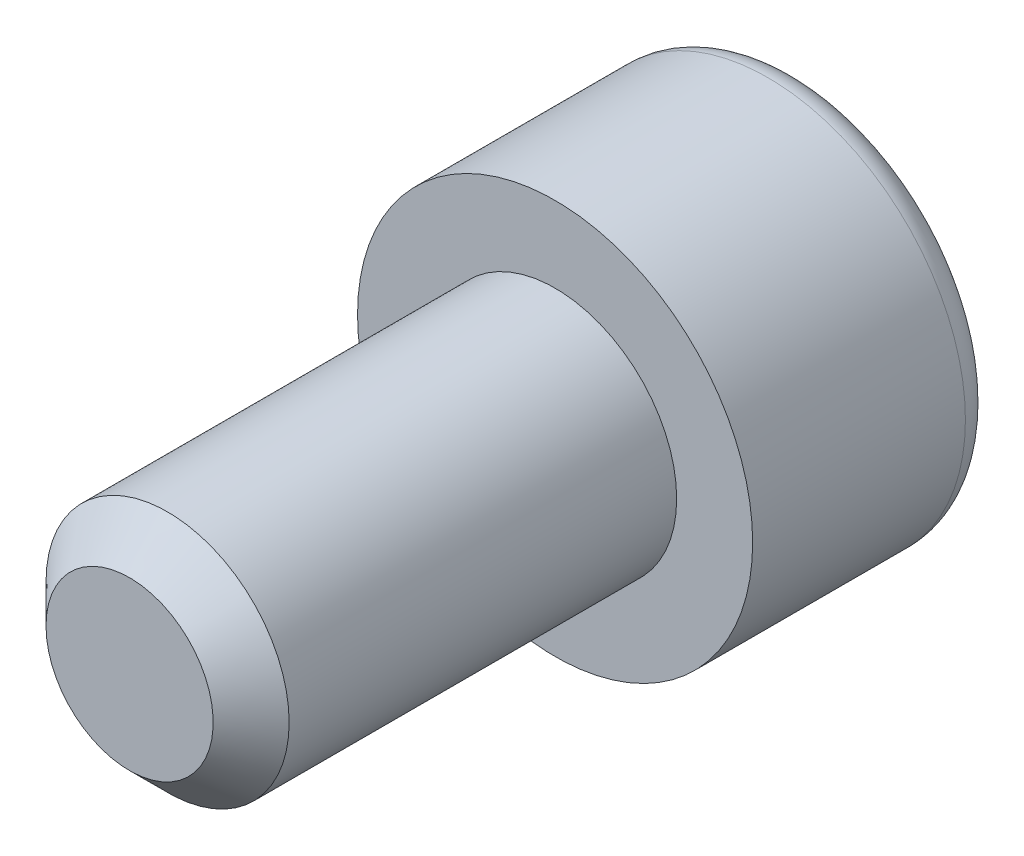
ISO-10303-21;
HEADER;
FILE_DESCRIPTION(('STEP AP214'),'2;1');
FILE_NAME('part.step','',(''),(''),'','','');
FILE_SCHEMA(('AUTOMOTIVE_DESIGN { 1 0 10303 214 1 1 1 1 }'));
ENDSEC;
DATA;
#1=APPLICATION_CONTEXT('core data for automotive mechanical design processes');
#2=APPLICATION_PROTOCOL_DEFINITION('international standard','automotive_design',2000,#1);
#3=PRODUCT_CONTEXT('',#1,'mechanical');
#4=PRODUCT('Part','Part','',(#3));
#5=PRODUCT_RELATED_PRODUCT_CATEGORY('part','',(#4));
#6=PRODUCT_DEFINITION_FORMATION('','',#4);
#7=PRODUCT_DEFINITION_CONTEXT('part definition',#1,'design');
#8=PRODUCT_DEFINITION('design','',#6,#7);
#9=PRODUCT_DEFINITION_SHAPE('','',#8);
#10=(LENGTH_UNIT() NAMED_UNIT(*) SI_UNIT(.MILLI.,.METRE.));
#11=(NAMED_UNIT(*) PLANE_ANGLE_UNIT() SI_UNIT($,.RADIAN.));
#12=(NAMED_UNIT(*) SI_UNIT($,.STERADIAN.) SOLID_ANGLE_UNIT());
#13=UNCERTAINTY_MEASURE_WITH_UNIT(LENGTH_MEASURE(1.E-05),#10,'distance_accuracy_value','');
#14=(GEOMETRIC_REPRESENTATION_CONTEXT(3) GLOBAL_UNCERTAINTY_ASSIGNED_CONTEXT((#13)) GLOBAL_UNIT_ASSIGNED_CONTEXT((#10,
#11,#12)) REPRESENTATION_CONTEXT('',''));
#15=CARTESIAN_POINT('',(0.,0.,0.));
#16=DIRECTION('',(0.,0.,1.));
#17=DIRECTION('',(1.,0.,0.));
#18=AXIS2_PLACEMENT_3D('',#15,#16,#17);
#19=CARTESIAN_POINT('',(0.,0.,14.));
#20=DIRECTION('',(0.,0.,-0.999999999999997));
#21=DIRECTION('',(-1.,0.,0.));
#22=AXIS2_PLACEMENT_3D('',#19,#20,#21);
#23=CYLINDRICAL_SURFACE('',#22,4.);
#24=CARTESIAN_POINT('',(0.,0.,12.75));
#25=DIRECTION('',(0.,0.,0.999999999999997));
#26=DIRECTION('',(1.,0.,0.));
#27=AXIS2_PLACEMENT_3D('',#24,#25,#26);
#28=CIRCLE('',#27,4.);
#29=CARTESIAN_POINT('',(-4.,0.,12.75));
#30=VERTEX_POINT('',#29);
#31=EDGE_CURVE('E145',#30,#30,#28,.F.);
#32=CARTESIAN_POINT('',(0.,0.,0.));
#33=DIRECTION('',(0.,0.,-0.999999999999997));
#34=DIRECTION('',(-1.,0.,0.));
#35=AXIS2_PLACEMENT_3D('',#32,#33,#34);
#36=CIRCLE('',#35,4.);
#37=CARTESIAN_POINT('',(-4.,0.,0.));
#38=VERTEX_POINT('',#37);
#39=EDGE_CURVE('E139',#38,#38,#36,.T.);
#40=CARTESIAN_POINT('',(-4.,0.,12.75));
#41=CARTESIAN_POINT('',(-4.,0.,12.6171875));
#42=CARTESIAN_POINT('',(-4.,0.,12.484375));
#43=CARTESIAN_POINT('',(-4.,0.,12.21875));
#44=CARTESIAN_POINT('',(-4.,0.,12.0859375));
#45=CARTESIAN_POINT('',(-4.,0.,11.8203125));
#46=CARTESIAN_POINT('',(-4.,0.,11.6875));
#47=CARTESIAN_POINT('',(-4.,0.,11.421875));
#48=CARTESIAN_POINT('',(-4.,0.,11.2890625));
#49=CARTESIAN_POINT('',(-4.,0.,11.0234375));
#50=CARTESIAN_POINT('',(-4.,0.,10.890625));
#51=CARTESIAN_POINT('',(-4.,0.,10.625));
#52=CARTESIAN_POINT('',(-4.,0.,10.4921875));
#53=CARTESIAN_POINT('',(-4.,0.,10.2265625));
#54=CARTESIAN_POINT('',(-4.,0.,10.09375));
#55=CARTESIAN_POINT('',(-4.,0.,9.82812500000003));
#56=CARTESIAN_POINT('',(-4.,0.,9.69531250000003));
#57=CARTESIAN_POINT('',(-4.,0.,9.42968750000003));
#58=CARTESIAN_POINT('',(-4.,0.,9.29687500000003));
#59=CARTESIAN_POINT('',(-4.,0.,9.03125000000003));
#60=CARTESIAN_POINT('',(-4.,0.,8.89843750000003));
#61=CARTESIAN_POINT('',(-4.,0.,8.63281250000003));
#62=CARTESIAN_POINT('',(-4.,0.,8.50000000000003));
#63=CARTESIAN_POINT('',(-4.,0.,8.23437500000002));
#64=CARTESIAN_POINT('',(-4.,0.,8.10156250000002));
#65=CARTESIAN_POINT('',(-4.,0.,7.83593750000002));
#66=CARTESIAN_POINT('',(-4.,0.,7.70312500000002));
#67=CARTESIAN_POINT('',(-4.,0.,7.43750000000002));
#68=CARTESIAN_POINT('',(-4.,0.,7.30468750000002));
#69=CARTESIAN_POINT('',(-4.,0.,7.03906250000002));
#70=CARTESIAN_POINT('',(-4.,0.,6.90625000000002));
#71=CARTESIAN_POINT('',(-4.,0.,6.64062500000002));
#72=CARTESIAN_POINT('',(-4.,0.,6.50781250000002));
#73=CARTESIAN_POINT('',(-4.,0.,6.24218750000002));
#74=CARTESIAN_POINT('',(-4.,0.,6.10937500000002));
#75=CARTESIAN_POINT('',(-4.,0.,5.84375000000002));
#76=CARTESIAN_POINT('',(-4.,0.,5.71093750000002));
#77=CARTESIAN_POINT('',(-4.,0.,5.44531250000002));
#78=CARTESIAN_POINT('',(-4.,0.,5.31250000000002));
#79=CARTESIAN_POINT('',(-4.,0.,5.04687500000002));
#80=CARTESIAN_POINT('',(-4.,0.,4.91406250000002));
#81=CARTESIAN_POINT('',(-4.,0.,4.64843750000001));
#82=CARTESIAN_POINT('',(-4.,0.,4.51562500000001));
#83=CARTESIAN_POINT('',(-4.,0.,4.25000000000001));
#84=CARTESIAN_POINT('',(-4.,0.,4.11718750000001));
#85=CARTESIAN_POINT('',(-4.,0.,3.85156250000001));
#86=CARTESIAN_POINT('',(-4.,0.,3.71875000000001));
#87=CARTESIAN_POINT('',(-4.,0.,3.45312500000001));
#88=CARTESIAN_POINT('',(-4.,0.,3.32031250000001));
#89=CARTESIAN_POINT('',(-4.,0.,3.05468750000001));
#90=CARTESIAN_POINT('',(-4.,0.,2.92187500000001));
#91=CARTESIAN_POINT('',(-4.,0.,2.65625000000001));
#92=CARTESIAN_POINT('',(-4.,0.,2.52343750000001));
#93=CARTESIAN_POINT('',(-4.,0.,2.25781250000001));
#94=CARTESIAN_POINT('',(-4.,0.,2.12500000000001));
#95=CARTESIAN_POINT('',(-4.,0.,1.85937500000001));
#96=CARTESIAN_POINT('',(-4.,0.,1.72656250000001));
#97=CARTESIAN_POINT('',(-4.,0.,1.4609375));
#98=CARTESIAN_POINT('',(-4.,0.,1.328125));
#99=CARTESIAN_POINT('',(-4.,0.,1.0625));
#100=CARTESIAN_POINT('',(-4.,0.,0.929687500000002));
#101=CARTESIAN_POINT('',(-4.,0.,0.664062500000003));
#102=CARTESIAN_POINT('',(-4.,0.,0.531250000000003));
#103=CARTESIAN_POINT('',(-4.,0.,0.265625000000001));
#104=CARTESIAN_POINT('',(-4.,0.,0.1328125));
#105=CARTESIAN_POINT('',(-4.,0.,0.));
#106=B_SPLINE_CURVE_WITH_KNOTS('',3,(#40,#41,#42,#43,#44,#45,#46,#47,#48,#49,#50,#51,#52,#53,
#54,#55,#56,#57,#58,#59,#60,#61,#62,#63,#64,#65,#66,#67,#68,#69,#70,#71,#72,#73,#74,#75,#76,#77,
#78,#79,#80,#81,#82,#83,#84,#85,#86,#87,#88,#89,#90,#91,#92,#93,#94,#95,#96,#97,#98,#99,#100,
#101,#102,#103,#104,#105),.UNSPECIFIED.,.F.,.F.,(4,2,2,2,2,2,2,2,2,2,2,2,2,2,2,2,2,2,2,2,2,2,2,
2,2,2,2,2,2,2,2,2,4),(0.,0.398437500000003,0.796875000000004,1.19531250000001,1.59375000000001,
1.99218750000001,2.39062500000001,2.78906250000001,3.18750000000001,3.58593750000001,
3.98437500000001,4.38281250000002,4.78125000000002,5.17968750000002,5.57812500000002,
5.97656250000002,6.37500000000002,6.77343750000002,7.17187500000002,7.57031250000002,
7.96875000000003,8.36718750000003,8.76562500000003,9.16406250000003,9.56250000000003,
9.96093750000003,10.359375,10.7578125,11.15625,11.5546875,11.953125,12.3515625,12.75),.UNSPECIFIED.);
#107=EDGE_CURVE('BSEAM28',#30,#38,#106,.T.);
#108=ORIENTED_EDGE('',*,*,#31,.T.);
#109=ORIENTED_EDGE('',*,*,#39,.F.);
#110=ORIENTED_EDGE('',*,*,#107,.T.);
#111=ORIENTED_EDGE('',*,*,#107,.F.);
#112=EDGE_LOOP('',(#108,#110,#109,#111));
#113=FACE_BOUND('',#112,.T.);
#114=ADVANCED_FACE('F28',(#113),#23,.T.);
#115=CARTESIAN_POINT('',(0.,0.,14.));
#116=DIRECTION('',(0.,0.,0.999999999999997));
#117=DIRECTION('',(1.,0.,0.));
#118=AXIS2_PLACEMENT_3D('',#115,#116,#117);
#119=PLANE('',#118);
#120=CARTESIAN_POINT('',(0.,0.,14.));
#121=DIRECTION('',(0.,0.,0.999999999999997));
#122=DIRECTION('',(1.,0.,0.));
#123=AXIS2_PLACEMENT_3D('',#120,#121,#122);
#124=CIRCLE('',#123,2.75);
#125=CARTESIAN_POINT('',(-2.75,0.,14.));
#126=VERTEX_POINT('',#125);
#127=EDGE_CURVE('E142',#126,#126,#124,.T.);
#128=ORIENTED_EDGE('',*,*,#127,.T.);
#129=EDGE_LOOP('',(#128));
#130=FACE_BOUND('',#129,.T.);
#131=ADVANCED_FACE('F166',(#130),#119,.T.);
#132=CARTESIAN_POINT('',(0.,0.,0.));
#133=DIRECTION('',(0.,0.,-0.999999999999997));
#134=DIRECTION('',(-1.,0.,0.));
#135=AXIS2_PLACEMENT_3D('',#132,#133,#134);
#136=PLANE('',#135);
#137=CARTESIAN_POINT('',(0.,0.,0.));
#138=DIRECTION('',(0.,0.,-0.999999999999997));
#139=DIRECTION('',(-1.,0.,0.));
#140=AXIS2_PLACEMENT_3D('',#137,#138,#139);
#141=CIRCLE('',#140,6.5);
#142=CARTESIAN_POINT('',(6.5,0.,0.));
#143=VERTEX_POINT('',#142);
#144=EDGE_CURVE('E130',#143,#143,#141,.T.);
#145=ORIENTED_EDGE('',*,*,#144,.F.);
#146=EDGE_LOOP('',(#145));
#147=FACE_BOUND('',#146,.T.);
#148=ORIENTED_EDGE('',*,*,#39,.T.);
#149=EDGE_LOOP('',(#148));
#150=FACE_BOUND('',#149,.T.);
#151=ADVANCED_FACE('F171',(#147,#150),#136,.F.);
#152=CARTESIAN_POINT('',(0.,0.,-7.9999999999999));
#153=DIRECTION('',(0.,0.,0.999999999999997));
#154=DIRECTION('',(1.,0.,0.));
#155=AXIS2_PLACEMENT_3D('',#152,#153,#154);
#156=CYLINDRICAL_SURFACE('',#155,6.5);
#157=CARTESIAN_POINT('',(0.,0.,-6.9999999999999));
#158=DIRECTION('',(0.,0.,-0.999999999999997));
#159=DIRECTION('',(-1.,0.,0.));
#160=AXIS2_PLACEMENT_3D('',#157,#158,#159);
#161=CIRCLE('',#160,6.5);
#162=CARTESIAN_POINT('',(6.5,0.,-6.99999999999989));
#163=VERTEX_POINT('',#162);
#164=EDGE_CURVE('E11',#163,#163,#161,.F.);
#165=CARTESIAN_POINT('',(6.5,0.,-6.99999999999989));
#166=CARTESIAN_POINT('',(6.5,0.,-6.92708333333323));
#167=CARTESIAN_POINT('',(6.5,0.,-6.85416666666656));
#168=CARTESIAN_POINT('',(6.5,0.,-6.70833333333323));
#169=CARTESIAN_POINT('',(6.5,0.,-6.63541666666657));
#170=CARTESIAN_POINT('',(6.5,0.,-6.48958333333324));
#171=CARTESIAN_POINT('',(6.5,0.,-6.41666666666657));
#172=CARTESIAN_POINT('',(6.5,0.,-6.27083333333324));
#173=CARTESIAN_POINT('',(6.5,0.,-6.19791666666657));
#174=CARTESIAN_POINT('',(6.5,0.,-6.05208333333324));
#175=CARTESIAN_POINT('',(6.5,0.,-5.97916666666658));
#176=CARTESIAN_POINT('',(6.5,0.,-5.83333333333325));
#177=CARTESIAN_POINT('',(6.5,0.,-5.76041666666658));
#178=CARTESIAN_POINT('',(6.5,0.,-5.61458333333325));
#179=CARTESIAN_POINT('',(6.5,0.,-5.54166666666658));
#180=CARTESIAN_POINT('',(6.5,0.,-5.39583333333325));
#181=CARTESIAN_POINT('',(6.5,0.,-5.32291666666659));
#182=CARTESIAN_POINT('',(6.5,0.,-5.17708333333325));
#183=CARTESIAN_POINT('',(6.5,0.,-5.10416666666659));
#184=CARTESIAN_POINT('',(6.5,0.,-4.95833333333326));
#185=CARTESIAN_POINT('',(6.5,0.,-4.88541666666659));
#186=CARTESIAN_POINT('',(6.5,0.,-4.73958333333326));
#187=CARTESIAN_POINT('',(6.5,0.,-4.6666666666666));
#188=CARTESIAN_POINT('',(6.5,0.,-4.52083333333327));
#189=CARTESIAN_POINT('',(6.5,0.,-4.4479166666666));
#190=CARTESIAN_POINT('',(6.5,0.,-4.30208333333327));
#191=CARTESIAN_POINT('',(6.5,0.,-4.2291666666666));
#192=CARTESIAN_POINT('',(6.5,0.,-4.08333333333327));
#193=CARTESIAN_POINT('',(6.5,0.,-4.01041666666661));
#194=CARTESIAN_POINT('',(6.5,0.,-3.86458333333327));
#195=CARTESIAN_POINT('',(6.5,0.,-3.79166666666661));
#196=CARTESIAN_POINT('',(6.5,0.,-3.64583333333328));
#197=CARTESIAN_POINT('',(6.5,0.,-3.57291666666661));
#198=CARTESIAN_POINT('',(6.5,0.,-3.42708333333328));
#199=CARTESIAN_POINT('',(6.5,0.,-3.35416666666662));
#200=CARTESIAN_POINT('',(6.5,0.,-3.20833333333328));
#201=CARTESIAN_POINT('',(6.5,0.,-3.13541666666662));
#202=CARTESIAN_POINT('',(6.5,0.,-2.98958333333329));
#203=CARTESIAN_POINT('',(6.5,0.,-2.91666666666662));
#204=CARTESIAN_POINT('',(6.5,0.,-2.77083333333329));
#205=CARTESIAN_POINT('',(6.5,0.,-2.69791666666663));
#206=CARTESIAN_POINT('',(6.5,0.,-2.55208333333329));
#207=CARTESIAN_POINT('',(6.5,0.,-2.47916666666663));
#208=CARTESIAN_POINT('',(6.5,0.,-2.3333333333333));
#209=CARTESIAN_POINT('',(6.5,0.,-2.26041666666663));
#210=CARTESIAN_POINT('',(6.5,0.,-2.1145833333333));
#211=CARTESIAN_POINT('',(6.5,0.,-2.04166666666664));
#212=CARTESIAN_POINT('',(6.5,0.,-1.8958333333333));
#213=CARTESIAN_POINT('',(6.5,0.,-1.82291666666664));
#214=CARTESIAN_POINT('',(6.5,0.,-1.67708333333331));
#215=CARTESIAN_POINT('',(6.5,0.,-1.60416666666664));
#216=CARTESIAN_POINT('',(6.5,0.,-1.45833333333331));
#217=CARTESIAN_POINT('',(6.5,0.,-1.38541666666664));
#218=CARTESIAN_POINT('',(6.5,0.,-1.23958333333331));
#219=CARTESIAN_POINT('',(6.5,0.,-1.16666666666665));
#220=CARTESIAN_POINT('',(6.5,0.,-1.02083333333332));
#221=CARTESIAN_POINT('',(6.5,0.,-0.947916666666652));
#222=CARTESIAN_POINT('',(6.5,0.,-0.80208333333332));
#223=CARTESIAN_POINT('',(6.5,0.,-0.729166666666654));
#224=CARTESIAN_POINT('',(6.5,0.,-0.583333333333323));
#225=CARTESIAN_POINT('',(6.5,0.,-0.510416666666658));
#226=CARTESIAN_POINT('',(6.5,0.,-0.364583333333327));
#227=CARTESIAN_POINT('',(6.5,0.,-0.291666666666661));
#228=CARTESIAN_POINT('',(6.5,0.,-0.14583333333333));
#229=CARTESIAN_POINT('',(6.5,0.,-0.0729166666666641));
#230=CARTESIAN_POINT('',(6.5,0.,0.));
#231=B_SPLINE_CURVE_WITH_KNOTS('',3,(#165,#166,#167,#168,#169,#170,#171,#172,#173,#174,#175,
#176,#177,#178,#179,#180,#181,#182,#183,#184,#185,#186,#187,#188,#189,#190,#191,#192,#193,#194,
#195,#196,#197,#198,#199,#200,#201,#202,#203,#204,#205,#206,#207,#208,#209,#210,#211,#212,#213,
#214,#215,#216,#217,#218,#219,#220,#221,#222,#223,#224,#225,#226,#227,#228,#229,#230),
.UNSPECIFIED.,.F.,.F.,(4,2,2,2,2,2,2,2,2,2,2,2,2,2,2,2,2,2,2,2,2,2,2,2,2,2,2,2,2,2,2,2,4),(0.,
0.218749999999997,0.437499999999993,0.65624999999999,0.874999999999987,1.09374999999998,
1.31249999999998,1.53124999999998,1.74999999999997,1.96874999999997,2.18749999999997,
2.40624999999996,2.62499999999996,2.84374999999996,3.06249999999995,3.28124999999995,
3.49999999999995,3.71874999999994,3.93749999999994,4.15624999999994,4.37499999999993,
4.59374999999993,4.81249999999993,5.03124999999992,5.24999999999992,5.46874999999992,
5.68749999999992,5.90624999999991,6.12499999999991,6.34374999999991,6.5624999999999,
6.7812499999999,6.9999999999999),.UNSPECIFIED.);
#232=EDGE_CURVE('BSEAM178',#163,#143,#231,.T.);
#233=ORIENTED_EDGE('',*,*,#164,.T.);
#234=ORIENTED_EDGE('',*,*,#144,.T.);
#235=ORIENTED_EDGE('',*,*,#232,.T.);
#236=ORIENTED_EDGE('',*,*,#232,.F.);
#237=EDGE_LOOP('',(#233,#235,#234,#236));
#238=FACE_BOUND('',#237,.T.);
#239=ADVANCED_FACE('F178',(#238),#156,.T.);
#240=CARTESIAN_POINT('',(0.,0.,-7.9999999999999));
#241=DIRECTION('',(0.,0.,-0.999999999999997));
#242=DIRECTION('',(-1.,0.,0.));
#243=AXIS2_PLACEMENT_3D('',#240,#241,#242);
#244=PLANE('',#243);
#245=DIRECTION('',(-0.977909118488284,-0.209030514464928,0.));
#246=VECTOR('',#245,1.);
#247=CARTESIAN_POINT('',(2.32087982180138,-2.57167588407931,-7.99999999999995));
#248=LINE('',#247,#246);
#249=CARTESIAN_POINT('',(2.32087982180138,-2.57167588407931,-7.99999999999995));
#250=VERTEX_POINT('',#249);
#251=CARTESIAN_POINT('',(-1.06669673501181,-3.29577882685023,-7.99999999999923));
#252=VERTEX_POINT('',#251);
#253=EDGE_CURVE('E42',#250,#252,#248,.T.);
#254=ORIENTED_EDGE('',*,*,#253,.F.);
#255=DIRECTION('',(-0.307928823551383,-0.951409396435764,0.));
#256=VECTOR('',#255,1.);
#257=CARTESIAN_POINT('',(3.38757655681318,0.724102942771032,-7.99999999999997));
#258=LINE('',#257,#256);
#259=CARTESIAN_POINT('',(3.38757655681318,0.724102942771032,-7.99999999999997));
#260=VERTEX_POINT('',#259);
#261=EDGE_CURVE('E112',#260,#250,#258,.T.);
#262=ORIENTED_EDGE('',*,*,#261,.F.);
#263=DIRECTION('',(0.6699802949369,-0.742378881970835,0.));
#264=VECTOR('',#263,1.);
#265=CARTESIAN_POINT('',(1.06669673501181,3.29577882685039,-7.99999999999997));
#266=LINE('',#265,#264);
#267=CARTESIAN_POINT('',(1.06669673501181,3.29577882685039,-7.99999999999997));
#268=VERTEX_POINT('',#267);
#269=EDGE_CURVE('E106',#268,#260,#266,.T.);
#270=ORIENTED_EDGE('',*,*,#269,.F.);
#271=DIRECTION('',(0.977909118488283,0.209030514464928,0.));
#272=VECTOR('',#271,1.);
#273=CARTESIAN_POINT('',(-2.3208798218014,2.57167588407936,-7.99999999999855));
#274=LINE('',#273,#272);
#275=CARTESIAN_POINT('',(-2.3208798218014,2.57167588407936,-7.99999999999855));
#276=VERTEX_POINT('',#275);
#277=EDGE_CURVE('E104',#276,#268,#274,.T.);
#278=ORIENTED_EDGE('',*,*,#277,.F.);
#279=DIRECTION('',(0.307928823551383,0.951409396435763,0.));
#280=VECTOR('',#279,1.);
#281=CARTESIAN_POINT('',(-3.38757655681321,-0.724102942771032,-7.99999999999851));
#282=LINE('',#281,#280);
#283=CARTESIAN_POINT('',(-3.38757655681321,-0.724102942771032,-7.99999999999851));
#284=VERTEX_POINT('',#283);
#285=EDGE_CURVE('E85',#284,#276,#282,.T.);
#286=ORIENTED_EDGE('',*,*,#285,.F.);
#287=DIRECTION('',(-0.6699802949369,0.742378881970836,0.));
#288=VECTOR('',#287,1.);
#289=CARTESIAN_POINT('',(-1.06669673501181,-3.29577882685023,-7.99999999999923));
#290=LINE('',#289,#288);
#291=EDGE_CURVE('E96',#252,#284,#290,.T.);
#292=ORIENTED_EDGE('',*,*,#291,.F.);
#293=EDGE_LOOP('',(#254,#262,#270,#278,#286,#292));
#294=FACE_BOUND('',#293,.T.);
#295=CARTESIAN_POINT('',(0.,0.,-7.9999999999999));
#296=DIRECTION('',(0.,0.,-0.999999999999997));
#297=DIRECTION('',(-1.,0.,0.));
#298=AXIS2_PLACEMENT_3D('',#295,#296,#297);
#299=CIRCLE('',#298,5.5);
#300=CARTESIAN_POINT('',(-5.5,0.,-7.9999999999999));
#301=VERTEX_POINT('',#300);
#302=EDGE_CURVE('E35',#301,#301,#299,.T.);
#303=ORIENTED_EDGE('',*,*,#302,.T.);
#304=EDGE_LOOP('',(#303));
#305=FACE_BOUND('',#304,.T.);
#306=ADVANCED_FACE('F100',(#294,#305),#244,.T.);
#307=CARTESIAN_POINT('',(0.,0.,14.));
#308=DIRECTION('',(0.,0.,-0.999999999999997));
#309=DIRECTION('',(-1.,0.,0.));
#310=AXIS2_PLACEMENT_3D('',#307,#308,#309);
#311=CONICAL_SURFACE('',#310,2.75,0.785398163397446);
#312=CARTESIAN_POINT('',(-3.99999999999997,0.,12.75));
#313=CARTESIAN_POINT('',(-3.98697916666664,0.,12.7630208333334));
#314=CARTESIAN_POINT('',(-3.97395833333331,0.,12.7760416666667));
#315=CARTESIAN_POINT('',(-3.94791666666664,0.,12.8020833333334));
#316=CARTESIAN_POINT('',(-3.93489583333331,0.,12.8151041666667));
#317=CARTESIAN_POINT('',(-3.90885416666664,0.,12.8411458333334));
#318=CARTESIAN_POINT('',(-3.89583333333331,0.,12.8541666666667));
#319=CARTESIAN_POINT('',(-3.86979166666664,0.,12.8802083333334));
#320=CARTESIAN_POINT('',(-3.85677083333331,0.,12.8932291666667));
#321=CARTESIAN_POINT('',(-3.83072916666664,0.,12.9192708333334));
#322=CARTESIAN_POINT('',(-3.81770833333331,0.,12.9322916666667));
#323=CARTESIAN_POINT('',(-3.79166666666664,0.,12.9583333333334));
#324=CARTESIAN_POINT('',(-3.77864583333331,0.,12.9713541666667));
#325=CARTESIAN_POINT('',(-3.75260416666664,0.,12.9973958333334));
#326=CARTESIAN_POINT('',(-3.73958333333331,0.,13.0104166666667));
#327=CARTESIAN_POINT('',(-3.71354166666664,0.,13.0364583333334));
#328=CARTESIAN_POINT('',(-3.70052083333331,0.,13.0494791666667));
#329=CARTESIAN_POINT('',(-3.67447916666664,0.,13.0755208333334));
#330=CARTESIAN_POINT('',(-3.66145833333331,0.,13.0885416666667));
#331=CARTESIAN_POINT('',(-3.63541666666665,0.,13.1145833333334));
#332=CARTESIAN_POINT('',(-3.62239583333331,0.,13.1276041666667));
#333=CARTESIAN_POINT('',(-3.59635416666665,0.,13.1536458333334));
#334=CARTESIAN_POINT('',(-3.58333333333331,0.,13.1666666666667));
#335=CARTESIAN_POINT('',(-3.55729166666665,0.,13.1927083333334));
#336=CARTESIAN_POINT('',(-3.54427083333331,0.,13.2057291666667));
#337=CARTESIAN_POINT('',(-3.51822916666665,0.,13.2317708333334));
#338=CARTESIAN_POINT('',(-3.50520833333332,0.,13.2447916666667));
#339=CARTESIAN_POINT('',(-3.47916666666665,0.,13.2708333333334));
#340=CARTESIAN_POINT('',(-3.46614583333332,0.,13.2838541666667));
#341=CARTESIAN_POINT('',(-3.44010416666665,0.,13.3098958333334));
#342=CARTESIAN_POINT('',(-3.42708333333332,0.,13.3229166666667));
#343=CARTESIAN_POINT('',(-3.40104166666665,0.,13.3489583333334));
#344=CARTESIAN_POINT('',(-3.38802083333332,0.,13.3619791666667));
#345=CARTESIAN_POINT('',(-3.36197916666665,0.,13.3880208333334));
#346=CARTESIAN_POINT('',(-3.34895833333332,0.,13.4010416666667));
#347=CARTESIAN_POINT('',(-3.32291666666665,0.,13.4270833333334));
#348=CARTESIAN_POINT('',(-3.30989583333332,0.,13.4401041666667));
#349=CARTESIAN_POINT('',(-3.28385416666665,0.,13.4661458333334));
#350=CARTESIAN_POINT('',(-3.27083333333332,0.,13.4791666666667));
#351=CARTESIAN_POINT('',(-3.24479166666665,0.,13.5052083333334));
#352=CARTESIAN_POINT('',(-3.23177083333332,0.,13.5182291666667));
#353=CARTESIAN_POINT('',(-3.20572916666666,0.,13.5442708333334));
#354=CARTESIAN_POINT('',(-3.19270833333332,0.,13.5572916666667));
#355=CARTESIAN_POINT('',(-3.16666666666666,0.,13.5833333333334));
#356=CARTESIAN_POINT('',(-3.15364583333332,0.,13.5963541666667));
#357=CARTESIAN_POINT('',(-3.12760416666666,0.,13.6223958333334));
#358=CARTESIAN_POINT('',(-3.11458333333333,0.,13.6354166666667));
#359=CARTESIAN_POINT('',(-3.08854166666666,0.,13.6614583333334));
#360=CARTESIAN_POINT('',(-3.07552083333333,0.,13.6744791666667));
#361=CARTESIAN_POINT('',(-3.04947916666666,0.,13.7005208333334));
#362=CARTESIAN_POINT('',(-3.03645833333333,0.,13.7135416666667));
#363=CARTESIAN_POINT('',(-3.01041666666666,0.,13.7395833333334));
#364=CARTESIAN_POINT('',(-2.99739583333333,0.,13.7526041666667));
#365=CARTESIAN_POINT('',(-2.97135416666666,0.,13.7786458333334));
#366=CARTESIAN_POINT('',(-2.95833333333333,0.,13.7916666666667));
#367=CARTESIAN_POINT('',(-2.93229166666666,0.,13.8177083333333));
#368=CARTESIAN_POINT('',(-2.91927083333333,0.,13.8307291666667));
#369=CARTESIAN_POINT('',(-2.89322916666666,0.,13.8567708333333));
#370=CARTESIAN_POINT('',(-2.88020833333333,0.,13.8697916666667));
#371=CARTESIAN_POINT('',(-2.85416666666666,0.,13.8958333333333));
#372=CARTESIAN_POINT('',(-2.84114583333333,0.,13.9088541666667));
#373=CARTESIAN_POINT('',(-2.81510416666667,0.,13.9348958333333));
#374=CARTESIAN_POINT('',(-2.80208333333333,0.,13.9479166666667));
#375=CARTESIAN_POINT('',(-2.77604166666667,0.,13.9739583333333));
#376=CARTESIAN_POINT('',(-2.76302083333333,0.,13.9869791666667));
#377=CARTESIAN_POINT('',(-2.75,0.,14.));
#378=B_SPLINE_CURVE_WITH_KNOTS('',3,(#312,#313,#314,#315,#316,#317,#318,#319,#320,#321,#322,
#323,#324,#325,#326,#327,#328,#329,#330,#331,#332,#333,#334,#335,#336,#337,#338,#339,#340,#341,
#342,#343,#344,#345,#346,#347,#348,#349,#350,#351,#352,#353,#354,#355,#356,#357,#358,#359,#360,
#361,#362,#363,#364,#365,#366,#367,#368,#369,#370,#371,#372,#373,#374,#375,#376,#377),
.UNSPECIFIED.,.F.,.F.,(4,2,2,2,2,2,2,2,2,2,2,2,2,2,2,2,2,2,2,2,2,2,2,2,2,2,2,2,2,2,2,2,4),(0.,
0.0552427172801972,0.110485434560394,0.165728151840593,0.22097086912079,0.276213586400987,
0.331456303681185,0.386699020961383,0.441941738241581,0.497184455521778,0.552427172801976,
0.607669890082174,0.662912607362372,0.718155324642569,0.773398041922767,0.828640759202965,
0.883883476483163,0.93912619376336,0.994368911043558,1.04961162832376,1.10485434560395,
1.16009706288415,1.21533978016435,1.27058249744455,1.32582521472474,1.38106793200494,
1.43631064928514,1.49155336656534,1.54679608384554,1.60203880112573,1.65728151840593,
1.71252423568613,1.76776695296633),.UNSPECIFIED.);
#379=EDGE_CURVE('BSEAM153',#30,#126,#378,.T.);
#380=ORIENTED_EDGE('',*,*,#31,.F.);
#381=ORIENTED_EDGE('',*,*,#127,.F.);
#382=ORIENTED_EDGE('',*,*,#379,.T.);
#383=ORIENTED_EDGE('',*,*,#379,.F.);
#384=EDGE_LOOP('',(#380,#382,#381,#383));
#385=FACE_BOUND('',#384,.T.);
#386=ADVANCED_FACE('F153',(#385),#311,.T.);
#387=CARTESIAN_POINT('',(0.,0.,-6.9999999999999));
#388=DIRECTION('',(0.,0.,-0.999999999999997));
#389=DIRECTION('',(-1.,0.,0.));
#390=AXIS2_PLACEMENT_3D('',#387,#388,#389);
#391=TOROIDAL_SURFACE('',#390,5.5,1.);
#392=ORIENTED_EDGE('',*,*,#164,.F.);
#393=EDGE_LOOP('',(#392));
#394=FACE_BOUND('',#393,.T.);
#395=ORIENTED_EDGE('',*,*,#302,.F.);
#396=EDGE_LOOP('',(#395));
#397=FACE_BOUND('',#396,.T.);
#398=ADVANCED_FACE('F150',(#394,#397),#391,.T.);
#399=CARTESIAN_POINT('',(2.32087982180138,-2.57167588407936,-2.));
#400=DIRECTION('',(0.209030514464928,-0.977909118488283,0.));
#401=DIRECTION('',(0.977909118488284,0.209030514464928,0.));
#402=AXIS2_PLACEMENT_3D('',#399,#400,#401);
#403=PLANE('',#402);
#404=ORIENTED_EDGE('',*,*,#253,.T.);
#405=DIRECTION('',(0.,0.,-0.999999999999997));
#406=VECTOR('',#405,1.);
#407=CARTESIAN_POINT('',(-1.06669673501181,-3.29577882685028,-1.99999999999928));
#408=LINE('',#407,#406);
#409=CARTESIAN_POINT('',(-1.06669673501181,-3.29577882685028,-1.99999999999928));
#410=VERTEX_POINT('',#409);
#411=EDGE_CURVE('E93',#410,#252,#408,.T.);
#412=ORIENTED_EDGE('',*,*,#411,.F.);
#413=DIRECTION('',(-0.977909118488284,-0.209030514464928,0.));
#414=VECTOR('',#413,1.);
#415=CARTESIAN_POINT('',(2.32087982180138,-2.57167588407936,-2.));
#416=LINE('',#415,#414);
#417=CARTESIAN_POINT('',(2.32087982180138,-2.57167588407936,-2.));
#418=VERTEX_POINT('',#417);
#419=EDGE_CURVE('E114',#418,#410,#416,.T.);
#420=ORIENTED_EDGE('',*,*,#419,.F.);
#421=DIRECTION('',(0.,0.,-0.999999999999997));
#422=VECTOR('',#421,1.);
#423=CARTESIAN_POINT('',(2.32087982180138,-2.57167588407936,-2.));
#424=LINE('',#423,#422);
#425=EDGE_CURVE('E49',#418,#250,#424,.T.);
#426=ORIENTED_EDGE('',*,*,#425,.T.);
#427=EDGE_LOOP('',(#404,#412,#420,#426));
#428=FACE_BOUND('',#427,.T.);
#429=ADVANCED_FACE('F152',(#428),#403,.F.);
#430=CARTESIAN_POINT('',(3.38757655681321,0.724102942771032,-1.99999999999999));
#431=DIRECTION('',(0.951409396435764,-0.307928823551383,0.));
#432=DIRECTION('',(0.307928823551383,0.951409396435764,0.));
#433=AXIS2_PLACEMENT_3D('',#430,#431,#432);
#434=PLANE('',#433);
#435=ORIENTED_EDGE('',*,*,#261,.T.);
#436=ORIENTED_EDGE('',*,*,#425,.F.);
#437=DIRECTION('',(-0.307928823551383,-0.951409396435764,0.));
#438=VECTOR('',#437,1.);
#439=CARTESIAN_POINT('',(3.38757655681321,0.724102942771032,-1.99999999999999));
#440=LINE('',#439,#438);
#441=CARTESIAN_POINT('',(3.38757655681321,0.724102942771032,-1.99999999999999));
#442=VERTEX_POINT('',#441);
#443=EDGE_CURVE('E126',#442,#418,#440,.T.);
#444=ORIENTED_EDGE('',*,*,#443,.F.);
#445=DIRECTION('',(0.,0.,-0.999999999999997));
#446=VECTOR('',#445,1.);
#447=CARTESIAN_POINT('',(3.38757655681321,0.724102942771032,-1.99999999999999));
#448=LINE('',#447,#446);
#449=EDGE_CURVE('E131',#442,#260,#448,.T.);
#450=ORIENTED_EDGE('',*,*,#449,.T.);
#451=EDGE_LOOP('',(#435,#436,#444,#450));
#452=FACE_BOUND('',#451,.T.);
#453=ADVANCED_FACE('F160',(#452),#434,.F.);
#454=CARTESIAN_POINT('',(1.06669673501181,3.29577882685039,-2.00000000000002));
#455=DIRECTION('',(0.742378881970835,0.6699802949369,0.));
#456=DIRECTION('',(-0.6699802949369,0.742378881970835,0.));
#457=AXIS2_PLACEMENT_3D('',#454,#455,#456);
#458=PLANE('',#457);
#459=ORIENTED_EDGE('',*,*,#269,.T.);
#460=ORIENTED_EDGE('',*,*,#449,.F.);
#461=DIRECTION('',(0.6699802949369,-0.742378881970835,0.));
#462=VECTOR('',#461,1.);
#463=CARTESIAN_POINT('',(1.06669673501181,3.29577882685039,-2.00000000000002));
#464=LINE('',#463,#462);
#465=CARTESIAN_POINT('',(1.06669673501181,3.29577882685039,-2.00000000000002));
#466=VERTEX_POINT('',#465);
#467=EDGE_CURVE('E123',#466,#442,#464,.T.);
#468=ORIENTED_EDGE('',*,*,#467,.F.);
#469=DIRECTION('',(0.,0.,-0.999999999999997));
#470=VECTOR('',#469,1.);
#471=CARTESIAN_POINT('',(1.06669673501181,3.29577882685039,-2.00000000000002));
#472=LINE('',#471,#470);
#473=EDGE_CURVE('E133',#466,#268,#472,.T.);
#474=ORIENTED_EDGE('',*,*,#473,.T.);
#475=EDGE_LOOP('',(#459,#460,#468,#474));
#476=FACE_BOUND('',#475,.T.);
#477=ADVANCED_FACE('F209',(#476),#458,.F.);
#478=CARTESIAN_POINT('',(-2.3208798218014,2.57167588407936,-1.9999999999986));
#479=DIRECTION('',(-0.209030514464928,0.977909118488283,0.));
#480=DIRECTION('',(-0.977909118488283,-0.209030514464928,0.));
#481=AXIS2_PLACEMENT_3D('',#478,#479,#480);
#482=PLANE('',#481);
#483=ORIENTED_EDGE('',*,*,#277,.T.);
#484=ORIENTED_EDGE('',*,*,#473,.F.);
#485=DIRECTION('',(0.977909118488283,0.209030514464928,0.));
#486=VECTOR('',#485,1.);
#487=CARTESIAN_POINT('',(-2.3208798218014,2.57167588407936,-1.9999999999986));
#488=LINE('',#487,#486);
#489=CARTESIAN_POINT('',(-2.3208798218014,2.57167588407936,-1.9999999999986));
#490=VERTEX_POINT('',#489);
#491=EDGE_CURVE('E120',#490,#466,#488,.T.);
#492=ORIENTED_EDGE('',*,*,#491,.F.);
#493=DIRECTION('',(0.,0.,-0.999999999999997));
#494=VECTOR('',#493,1.);
#495=CARTESIAN_POINT('',(-2.3208798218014,2.57167588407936,-1.9999999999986));
#496=LINE('',#495,#494);
#497=EDGE_CURVE('E92',#490,#276,#496,.T.);
#498=ORIENTED_EDGE('',*,*,#497,.T.);
#499=EDGE_LOOP('',(#483,#484,#492,#498));
#500=FACE_BOUND('',#499,.T.);
#501=ADVANCED_FACE('F206',(#500),#482,.F.);
#502=CARTESIAN_POINT('',(-3.38757655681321,-0.724102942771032,-1.99999999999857));
#503=DIRECTION('',(-0.951409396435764,0.307928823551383,0.));
#504=DIRECTION('',(-0.307928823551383,-0.951409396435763,0.));
#505=AXIS2_PLACEMENT_3D('',#502,#503,#504);
#506=PLANE('',#505);
#507=ORIENTED_EDGE('',*,*,#285,.T.);
#508=ORIENTED_EDGE('',*,*,#497,.F.);
#509=DIRECTION('',(0.307928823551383,0.951409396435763,0.));
#510=VECTOR('',#509,1.);
#511=CARTESIAN_POINT('',(-3.38757655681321,-0.724102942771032,-1.99999999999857));
#512=LINE('',#511,#510);
#513=CARTESIAN_POINT('',(-3.38757655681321,-0.724102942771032,-1.99999999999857));
#514=VERTEX_POINT('',#513);
#515=EDGE_CURVE('E88',#514,#490,#512,.T.);
#516=ORIENTED_EDGE('',*,*,#515,.F.);
#517=DIRECTION('',(0.,0.,-0.999999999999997));
#518=VECTOR('',#517,1.);
#519=CARTESIAN_POINT('',(-3.38757655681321,-0.724102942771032,-1.99999999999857));
#520=LINE('',#519,#518);
#521=EDGE_CURVE('E81',#514,#284,#520,.T.);
#522=ORIENTED_EDGE('',*,*,#521,.T.);
#523=EDGE_LOOP('',(#507,#508,#516,#522));
#524=FACE_BOUND('',#523,.T.);
#525=ADVANCED_FACE('F83',(#524),#506,.F.);
#526=CARTESIAN_POINT('',(-1.06669673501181,-3.29577882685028,-1.99999999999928));
#527=DIRECTION('',(-0.742378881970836,-0.6699802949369,0.));
#528=DIRECTION('',(0.6699802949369,-0.742378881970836,0.));
#529=AXIS2_PLACEMENT_3D('',#526,#527,#528);
#530=PLANE('',#529);
#531=ORIENTED_EDGE('',*,*,#291,.T.);
#532=ORIENTED_EDGE('',*,*,#521,.F.);
#533=DIRECTION('',(-0.6699802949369,0.742378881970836,0.));
#534=VECTOR('',#533,1.);
#535=CARTESIAN_POINT('',(-1.06669673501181,-3.29577882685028,-1.99999999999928));
#536=LINE('',#535,#534);
#537=EDGE_CURVE('E117',#410,#514,#536,.T.);
#538=ORIENTED_EDGE('',*,*,#537,.F.);
#539=ORIENTED_EDGE('',*,*,#411,.T.);
#540=EDGE_LOOP('',(#531,#532,#538,#539));
#541=FACE_BOUND('',#540,.T.);
#542=ADVANCED_FACE('F97',(#541),#530,.F.);
#543=CARTESIAN_POINT('',(2.3208798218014,-2.57167588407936,-2.));
#544=DIRECTION('',(0.,0.,0.999999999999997));
#545=DIRECTION('',(1.,0.,0.));
#546=AXIS2_PLACEMENT_3D('',#543,#544,#545);
#547=PLANE('',#546);
#548=ORIENTED_EDGE('',*,*,#419,.T.);
#549=ORIENTED_EDGE('',*,*,#537,.T.);
#550=ORIENTED_EDGE('',*,*,#515,.T.);
#551=ORIENTED_EDGE('',*,*,#491,.T.);
#552=ORIENTED_EDGE('',*,*,#467,.T.);
#553=ORIENTED_EDGE('',*,*,#443,.T.);
#554=EDGE_LOOP('',(#548,#549,#550,#551,#552,#553));
#555=FACE_BOUND('',#554,.T.);
#556=ADVANCED_FACE('F203',(#555),#547,.F.);
#557=CLOSED_SHELL('',(#114,#131,#151,#239,#306,#386,#398,#429,#453,#477,#501,#525,#542,#556));
#558=MANIFOLD_SOLID_BREP('B2',#557);
#559=ADVANCED_BREP_SHAPE_REPRESENTATION('',(#18,#558),#14);
#560=SHAPE_DEFINITION_REPRESENTATION(#9,#559);
ENDSEC;
END-ISO-10303-21;
